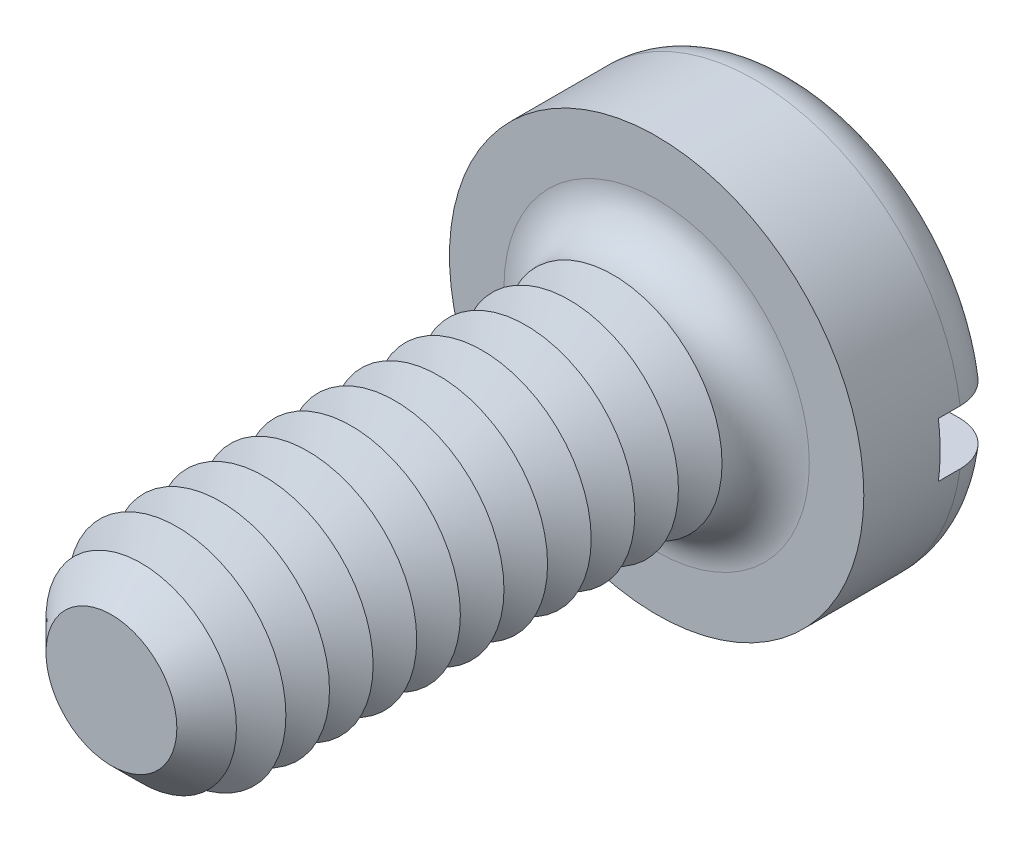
from build123d import *

# Parameters (mm, degrees)
SKETCH3_R           = 1.9
BOSS_EXTRUDE2_DEPTH = 1.3
SKETCH4_R           = 1
BOSS_EXTRUDE3_DEPTH = 5
FILLET1_R           = 0.4
CHAMFER1_SIZE       = 0.4
LPATTERN1_COUNT     = 11
LPATTERN1_PITCH     = 0.4
SKETCH8_W           = 3.8
SKETCH8_H           = 0.5
CUT_EXTRUDE1_DEPTH  = 0.6


with BuildPart() as part:
    # Sketch3 → Boss-Extrude2 (new body)
    with BuildSketch(Plane.XY):
        Circle(SKETCH3_R)
    extrude(amount=-BOSS_EXTRUDE2_DEPTH)

    # Sketch4 → Boss-Extrude3 (add)
    with BuildSketch(Plane.XY):
        Circle(SKETCH4_R)
    extrude(amount=BOSS_EXTRUDE3_DEPTH)

    # Fillet1
    fillet1_edges = [part.edges().sort_by_distance(p)[0] for p in [
        (-1.9, 0, -1.3),
        (-1, 0, 0),
    ]]
    fillet(fillet1_edges, radius=FILLET1_R)

    # Chamfer1
    chamfer1_edges = [part.edges().sort_by_distance(p)[0] for p in [
        (-1, 0, 5),
    ]]
    chamfer(chamfer1_edges, length=CHAMFER1_SIZE)

    # Sketch6 → Cut-Revolve1 (revolve, cut)
    with BuildSketch(Plane(origin=(0, 0, 0), x_dir=(0, 0, -1), z_dir=(1, 0, 0)), mode=Mode.PRIVATE) as cut_revolve1_sk:
        Polygon((-0.4, 1), (-0.6, 0.653589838), (-0.8, 1), align=None)
    cut_revolve1 = revolve(cut_revolve1_sk.sketch.rotate(Axis((0, 0, -1.694361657), (0, 0, 1)), 90), axis=Axis((0, 0, -1.694361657), (0, 0, 1)), mode=Mode.SUBTRACT)

    # LPattern1: Cut-Revolve1 ×11
    with Locations(*[(0, 0, i * LPATTERN1_PITCH) for i in range(1, LPATTERN1_COUNT)]):
        add(cut_revolve1, mode=Mode.SUBTRACT)

    # Sketch8 → Cut-Extrude1 (cut)
    with BuildSketch(Plane(origin=(0, 0, -1.3), x_dir=(-1, 0, 0), z_dir=(0, 0, -1))):
        Rectangle(SKETCH8_W, SKETCH8_H)
    extrude(amount=-CUT_EXTRUDE1_DEPTH, mode=Mode.SUBTRACT)


solid = part.part
